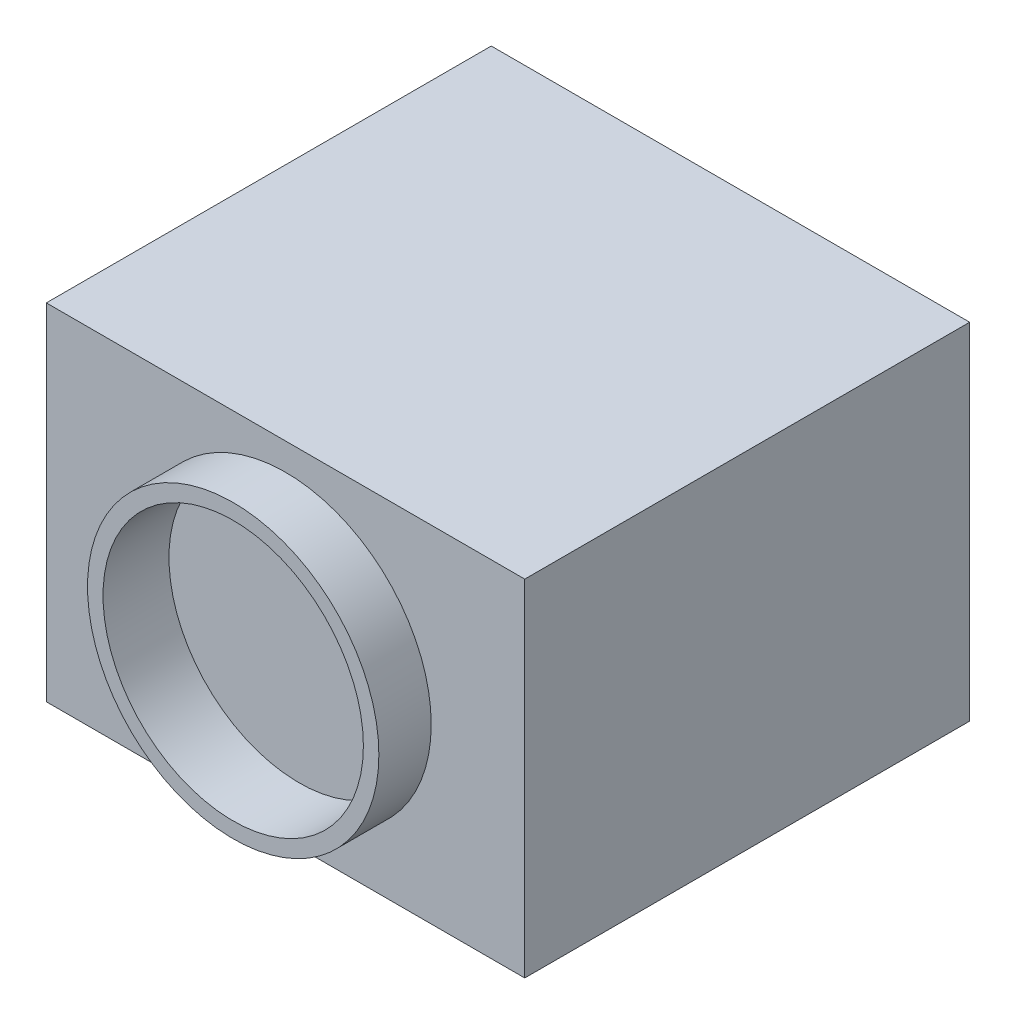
ISO-10303-21;
HEADER;
FILE_DESCRIPTION(('STEP AP214'),'2;1');
FILE_NAME('part.step','',(''),(''),'','','');
FILE_SCHEMA(('AUTOMOTIVE_DESIGN { 1 0 10303 214 1 1 1 1 }'));
ENDSEC;
DATA;
#1=APPLICATION_CONTEXT('core data for automotive mechanical design processes');
#2=APPLICATION_PROTOCOL_DEFINITION('international standard','automotive_design',2000,#1);
#3=PRODUCT_CONTEXT('',#1,'mechanical');
#4=PRODUCT('Part','Part','',(#3));
#5=PRODUCT_RELATED_PRODUCT_CATEGORY('part','',(#4));
#6=PRODUCT_DEFINITION_FORMATION('','',#4);
#7=PRODUCT_DEFINITION_CONTEXT('part definition',#1,'design');
#8=PRODUCT_DEFINITION('design','',#6,#7);
#9=PRODUCT_DEFINITION_SHAPE('','',#8);
#10=(LENGTH_UNIT() NAMED_UNIT(*) SI_UNIT(.MILLI.,.METRE.));
#11=(NAMED_UNIT(*) PLANE_ANGLE_UNIT() SI_UNIT($,.RADIAN.));
#12=(NAMED_UNIT(*) SI_UNIT($,.STERADIAN.) SOLID_ANGLE_UNIT());
#13=UNCERTAINTY_MEASURE_WITH_UNIT(LENGTH_MEASURE(1.E-05),#10,'distance_accuracy_value','');
#14=(GEOMETRIC_REPRESENTATION_CONTEXT(3) GLOBAL_UNCERTAINTY_ASSIGNED_CONTEXT((#13)) GLOBAL_UNIT_ASSIGNED_CONTEXT((#10,
#11,#12)) REPRESENTATION_CONTEXT('',''));
#15=CARTESIAN_POINT('',(0.,0.,0.));
#16=DIRECTION('',(0.,0.,1.));
#17=DIRECTION('',(1.,0.,0.));
#18=AXIS2_PLACEMENT_3D('',#15,#16,#17);
#19=CARTESIAN_POINT('',(-22.85,-16.5,0.));
#20=DIRECTION('',(0.,0.,1.));
#21=DIRECTION('',(1.,0.,0.));
#22=AXIS2_PLACEMENT_3D('',#19,#20,#21);
#23=PLANE('',#22);
#24=DIRECTION('',(0.,-1.,0.));
#25=VECTOR('',#24,1.);
#26=CARTESIAN_POINT('',(-22.85,16.5,0.));
#27=LINE('',#26,#25);
#28=CARTESIAN_POINT('',(-22.85,16.5,0.));
#29=VERTEX_POINT('',#28);
#30=CARTESIAN_POINT('',(-22.85,-16.5,0.));
#31=VERTEX_POINT('',#30);
#32=EDGE_CURVE('E195',#29,#31,#27,.T.);
#33=ORIENTED_EDGE('',*,*,#32,.F.);
#34=DIRECTION('',(-1.,0.,0.));
#35=VECTOR('',#34,1.);
#36=CARTESIAN_POINT('',(-22.85,16.5,0.));
#37=LINE('',#36,#35);
#38=CARTESIAN_POINT('',(22.85,16.5,0.));
#39=VERTEX_POINT('',#38);
#40=EDGE_CURVE('E202',#39,#29,#37,.T.);
#41=ORIENTED_EDGE('',*,*,#40,.F.);
#42=DIRECTION('',(0.,1.,0.));
#43=VECTOR('',#42,1.);
#44=CARTESIAN_POINT('',(22.85,16.5,0.));
#45=LINE('',#44,#43);
#46=CARTESIAN_POINT('',(22.85,-16.5,0.));
#47=VERTEX_POINT('',#46);
#48=EDGE_CURVE('E213',#47,#39,#45,.T.);
#49=ORIENTED_EDGE('',*,*,#48,.F.);
#50=DIRECTION('',(1.,0.,0.));
#51=VECTOR('',#50,1.);
#52=CARTESIAN_POINT('',(-22.85,-16.5,0.));
#53=LINE('',#52,#51);
#54=EDGE_CURVE('E211',#31,#47,#53,.T.);
#55=ORIENTED_EDGE('',*,*,#54,.F.);
#56=EDGE_LOOP('',(#33,#41,#49,#55));
#57=FACE_BOUND('',#56,.T.);
#58=DIRECTION('',(0.,-1.,0.));
#59=VECTOR('',#58,1.);
#60=CARTESIAN_POINT('',(7.66299935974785,-5.44476270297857,0.));
#61=LINE('',#60,#59);
#62=CARTESIAN_POINT('',(7.66299935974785,-5.44476270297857,0.));
#63=VERTEX_POINT('',#62);
#64=CARTESIAN_POINT('',(7.66299935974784,-15.6620951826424,0.));
#65=VERTEX_POINT('',#64);
#66=EDGE_CURVE('E138',#63,#65,#61,.T.);
#67=ORIENTED_EDGE('',*,*,#66,.F.);
#68=DIRECTION('',(1.,0.,0.));
#69=VECTOR('',#68,1.);
#70=CARTESIAN_POINT('',(7.66299935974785,-5.44476270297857,0.));
#71=LINE('',#70,#69);
#72=CARTESIAN_POINT('',(-5.57920128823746,-5.44476270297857,0.));
#73=VERTEX_POINT('',#72);
#74=EDGE_CURVE('E168',#73,#63,#71,.T.);
#75=ORIENTED_EDGE('',*,*,#74,.F.);
#76=DIRECTION('',(0.,1.,0.));
#77=VECTOR('',#76,1.);
#78=CARTESIAN_POINT('',(-5.57920128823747,-5.44476270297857,0.));
#79=LINE('',#78,#77);
#80=CARTESIAN_POINT('',(-5.57920128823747,-15.6620951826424,0.));
#81=VERTEX_POINT('',#80);
#82=EDGE_CURVE('E52',#81,#73,#79,.T.);
#83=ORIENTED_EDGE('',*,*,#82,.F.);
#84=DIRECTION('',(-1.,0.,0.));
#85=VECTOR('',#84,1.);
#86=CARTESIAN_POINT('',(7.66299935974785,-15.6620951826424,0.));
#87=LINE('',#86,#85);
#88=EDGE_CURVE('E47',#65,#81,#87,.T.);
#89=ORIENTED_EDGE('',*,*,#88,.F.);
#90=EDGE_LOOP('',(#67,#75,#83,#89));
#91=FACE_BOUND('',#90,.T.);
#92=CARTESIAN_POINT('',(-13.5110778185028,0.,0.));
#93=DIRECTION('',(0.,0.,1.));
#94=DIRECTION('',(1.,0.,0.));
#95=AXIS2_PLACEMENT_3D('',#92,#93,#94);
#96=CIRCLE('',#95,5.78007749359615);
#97=CARTESIAN_POINT('',(-7.73100032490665,0.,0.));
#98=VERTEX_POINT('',#97);
#99=EDGE_CURVE('E11',#98,#98,#96,.F.);
#100=ORIENTED_EDGE('',*,*,#99,.F.);
#101=EDGE_LOOP('',(#100));
#102=FACE_BOUND('',#101,.T.);
#103=ADVANCED_FACE('F32',(#57,#91,#102),#23,.F.);
#104=CARTESIAN_POINT('',(-22.85,-16.5,42.5));
#105=DIRECTION('',(0.,0.,1.));
#106=DIRECTION('',(1.,0.,0.));
#107=AXIS2_PLACEMENT_3D('',#104,#105,#106);
#108=PLANE('',#107);
#109=DIRECTION('',(0.,-1.,0.));
#110=VECTOR('',#109,1.);
#111=CARTESIAN_POINT('',(-22.85,16.5,42.5));
#112=LINE('',#111,#110);
#113=CARTESIAN_POINT('',(-22.85,16.5,42.5));
#114=VERTEX_POINT('',#113);
#115=CARTESIAN_POINT('',(-22.85,-16.5,42.5));
#116=VERTEX_POINT('',#115);
#117=EDGE_CURVE('E198',#114,#116,#112,.T.);
#118=ORIENTED_EDGE('',*,*,#117,.T.);
#119=DIRECTION('',(1.,0.,0.));
#120=VECTOR('',#119,1.);
#121=CARTESIAN_POINT('',(-22.85,-16.5,42.5));
#122=LINE('',#121,#120);
#123=CARTESIAN_POINT('',(22.85,-16.5,42.5));
#124=VERTEX_POINT('',#123);
#125=EDGE_CURVE('E201',#116,#124,#122,.T.);
#126=ORIENTED_EDGE('',*,*,#125,.T.);
#127=DIRECTION('',(0.,1.,0.));
#128=VECTOR('',#127,1.);
#129=CARTESIAN_POINT('',(22.85,16.5,42.5));
#130=LINE('',#129,#128);
#131=CARTESIAN_POINT('',(22.85,16.5,42.5));
#132=VERTEX_POINT('',#131);
#133=EDGE_CURVE('E204',#124,#132,#130,.T.);
#134=ORIENTED_EDGE('',*,*,#133,.T.);
#135=DIRECTION('',(-1.,0.,0.));
#136=VECTOR('',#135,1.);
#137=CARTESIAN_POINT('',(-22.85,16.5,42.5));
#138=LINE('',#137,#136);
#139=EDGE_CURVE('E206',#132,#114,#138,.T.);
#140=ORIENTED_EDGE('',*,*,#139,.T.);
#141=EDGE_LOOP('',(#118,#126,#134,#140));
#142=FACE_BOUND('',#141,.T.);
#143=CARTESIAN_POINT('',(0.,0.,42.5));
#144=DIRECTION('',(0.,0.,1.));
#145=DIRECTION('',(1.,0.,0.));
#146=AXIS2_PLACEMENT_3D('',#143,#144,#145);
#147=CIRCLE('',#146,13.9150736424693);
#148=CARTESIAN_POINT('',(13.9150736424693,0.,42.5));
#149=VERTEX_POINT('',#148);
#150=EDGE_CURVE('E191',#149,#149,#147,.T.);
#151=ORIENTED_EDGE('',*,*,#150,.F.);
#152=EDGE_LOOP('',(#151));
#153=FACE_BOUND('',#152,.T.);
#154=ADVANCED_FACE('F243',(#142,#153),#108,.T.);
#155=CARTESIAN_POINT('',(-22.85,16.5,42.5));
#156=DIRECTION('',(1.,0.,0.));
#157=DIRECTION('',(0.,1.,0.));
#158=AXIS2_PLACEMENT_3D('',#155,#156,#157);
#159=PLANE('',#158);
#160=ORIENTED_EDGE('',*,*,#32,.T.);
#161=DIRECTION('',(0.,0.,-1.));
#162=VECTOR('',#161,1.);
#163=CARTESIAN_POINT('',(-22.85,-16.5,42.5));
#164=LINE('',#163,#162);
#165=EDGE_CURVE('E40',#116,#31,#164,.T.);
#166=ORIENTED_EDGE('',*,*,#165,.F.);
#167=ORIENTED_EDGE('',*,*,#117,.F.);
#168=DIRECTION('',(0.,0.,-1.));
#169=VECTOR('',#168,1.);
#170=CARTESIAN_POINT('',(-22.85,16.5,42.5));
#171=LINE('',#170,#169);
#172=EDGE_CURVE('E208',#114,#29,#171,.T.);
#173=ORIENTED_EDGE('',*,*,#172,.T.);
#174=EDGE_LOOP('',(#160,#166,#167,#173));
#175=FACE_BOUND('',#174,.T.);
#176=ADVANCED_FACE('F34',(#175),#159,.F.);
#177=CARTESIAN_POINT('',(-22.85,-16.5,42.5));
#178=DIRECTION('',(0.,1.,0.));
#179=DIRECTION('',(0.,0.,1.));
#180=AXIS2_PLACEMENT_3D('',#177,#178,#179);
#181=PLANE('',#180);
#182=ORIENTED_EDGE('',*,*,#54,.T.);
#183=DIRECTION('',(0.,0.,-1.));
#184=VECTOR('',#183,1.);
#185=CARTESIAN_POINT('',(22.85,-16.5,42.5));
#186=LINE('',#185,#184);
#187=EDGE_CURVE('E221',#124,#47,#186,.T.);
#188=ORIENTED_EDGE('',*,*,#187,.F.);
#189=ORIENTED_EDGE('',*,*,#125,.F.);
#190=ORIENTED_EDGE('',*,*,#165,.T.);
#191=EDGE_LOOP('',(#182,#188,#189,#190));
#192=FACE_BOUND('',#191,.T.);
#193=ADVANCED_FACE('F226',(#192),#181,.F.);
#194=CARTESIAN_POINT('',(22.85,16.5,42.5));
#195=DIRECTION('',(-1.,0.,0.));
#196=DIRECTION('',(0.,-1.,0.));
#197=AXIS2_PLACEMENT_3D('',#194,#195,#196);
#198=PLANE('',#197);
#199=ORIENTED_EDGE('',*,*,#48,.T.);
#200=DIRECTION('',(0.,0.,-1.));
#201=VECTOR('',#200,1.);
#202=CARTESIAN_POINT('',(22.85,16.5,42.5));
#203=LINE('',#202,#201);
#204=EDGE_CURVE('E218',#132,#39,#203,.T.);
#205=ORIENTED_EDGE('',*,*,#204,.F.);
#206=ORIENTED_EDGE('',*,*,#133,.F.);
#207=ORIENTED_EDGE('',*,*,#187,.T.);
#208=EDGE_LOOP('',(#199,#205,#206,#207));
#209=FACE_BOUND('',#208,.T.);
#210=ADVANCED_FACE('F237',(#209),#198,.F.);
#211=CARTESIAN_POINT('',(-22.85,16.5,42.5));
#212=DIRECTION('',(0.,-1.,0.));
#213=DIRECTION('',(0.,0.,-1.));
#214=AXIS2_PLACEMENT_3D('',#211,#212,#213);
#215=PLANE('',#214);
#216=ORIENTED_EDGE('',*,*,#40,.T.);
#217=ORIENTED_EDGE('',*,*,#172,.F.);
#218=ORIENTED_EDGE('',*,*,#139,.F.);
#219=ORIENTED_EDGE('',*,*,#204,.T.);
#220=EDGE_LOOP('',(#216,#217,#218,#219));
#221=FACE_BOUND('',#220,.T.);
#222=ADVANCED_FACE('F241',(#221),#215,.F.);
#223=CARTESIAN_POINT('',(0.,0.,47.5));
#224=DIRECTION('',(0.,0.,-1.));
#225=DIRECTION('',(-1.,0.,0.));
#226=AXIS2_PLACEMENT_3D('',#223,#224,#225);
#227=CYLINDRICAL_SURFACE('',#226,13.9150736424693);
#228=CARTESIAN_POINT('',(0.,0.,47.5));
#229=DIRECTION('',(0.,0.,1.));
#230=DIRECTION('',(1.,0.,0.));
#231=AXIS2_PLACEMENT_3D('',#228,#229,#230);
#232=CIRCLE('',#231,13.9150736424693);
#233=CARTESIAN_POINT('',(13.9150736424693,0.,47.5));
#234=VERTEX_POINT('',#233);
#235=EDGE_CURVE('E192',#234,#234,#232,.T.);
#236=ORIENTED_EDGE('',*,*,#235,.F.);
#237=EDGE_LOOP('',(#236));
#238=FACE_BOUND('',#237,.T.);
#239=ORIENTED_EDGE('',*,*,#150,.T.);
#240=EDGE_LOOP('',(#239));
#241=FACE_BOUND('',#240,.T.);
#242=ADVANCED_FACE('F249',(#238,#241),#227,.T.);
#243=CARTESIAN_POINT('',(0.,0.,47.5));
#244=DIRECTION('',(0.,0.,1.));
#245=DIRECTION('',(1.,0.,0.));
#246=AXIS2_PLACEMENT_3D('',#243,#244,#245);
#247=PLANE('',#246);
#248=CARTESIAN_POINT('',(0.,0.,47.5));
#249=DIRECTION('',(0.,0.,1.));
#250=DIRECTION('',(1.,0.,0.));
#251=AXIS2_PLACEMENT_3D('',#248,#249,#250);
#252=CIRCLE('',#251,12.4355691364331);
#253=CARTESIAN_POINT('',(12.4355691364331,0.,47.5));
#254=VERTEX_POINT('',#253);
#255=EDGE_CURVE('E350',#254,#254,#252,.T.);
#256=ORIENTED_EDGE('',*,*,#255,.F.);
#257=EDGE_LOOP('',(#256));
#258=FACE_BOUND('',#257,.T.);
#259=ORIENTED_EDGE('',*,*,#235,.T.);
#260=EDGE_LOOP('',(#259));
#261=FACE_BOUND('',#260,.T.);
#262=ADVANCED_FACE('F251',(#258,#261),#247,.T.);
#263=CARTESIAN_POINT('',(7.66299935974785,-15.6620951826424,-6.3));
#264=DIRECTION('',(0.,0.,-1.));
#265=DIRECTION('',(-1.,0.,0.));
#266=AXIS2_PLACEMENT_3D('',#263,#264,#265);
#267=PLANE('',#266);
#268=DIRECTION('',(0.,-1.,0.));
#269=VECTOR('',#268,1.);
#270=CARTESIAN_POINT('',(7.66299935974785,-5.44476270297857,-6.3));
#271=LINE('',#270,#269);
#272=CARTESIAN_POINT('',(7.66299935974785,-5.44476270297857,-6.3));
#273=VERTEX_POINT('',#272);
#274=CARTESIAN_POINT('',(7.66299935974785,-15.6620951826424,-6.3));
#275=VERTEX_POINT('',#274);
#276=EDGE_CURVE('E164',#273,#275,#271,.T.);
#277=ORIENTED_EDGE('',*,*,#276,.T.);
#278=DIRECTION('',(-1.,0.,0.));
#279=VECTOR('',#278,1.);
#280=CARTESIAN_POINT('',(7.66299935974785,-15.6620951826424,-6.3));
#281=LINE('',#280,#279);
#282=CARTESIAN_POINT('',(-5.57920128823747,-15.6620951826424,-6.3));
#283=VERTEX_POINT('',#282);
#284=EDGE_CURVE('E167',#275,#283,#281,.T.);
#285=ORIENTED_EDGE('',*,*,#284,.T.);
#286=DIRECTION('',(0.,1.,0.));
#287=VECTOR('',#286,1.);
#288=CARTESIAN_POINT('',(-5.57920128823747,-5.44476270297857,-6.3));
#289=LINE('',#288,#287);
#290=CARTESIAN_POINT('',(-5.57920128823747,-5.44476270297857,-6.3));
#291=VERTEX_POINT('',#290);
#292=EDGE_CURVE('E170',#283,#291,#289,.T.);
#293=ORIENTED_EDGE('',*,*,#292,.T.);
#294=DIRECTION('',(1.,0.,0.));
#295=VECTOR('',#294,1.);
#296=CARTESIAN_POINT('',(7.66299935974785,-5.44476270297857,-6.3));
#297=LINE('',#296,#295);
#298=EDGE_CURVE('E172',#291,#273,#297,.T.);
#299=ORIENTED_EDGE('',*,*,#298,.T.);
#300=EDGE_LOOP('',(#277,#285,#293,#299));
#301=FACE_BOUND('',#300,.T.);
#302=DIRECTION('',(-1.,0.,0.));
#303=VECTOR('',#302,1.);
#304=CARTESIAN_POINT('',(6.5202713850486,-14.5865865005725,-6.3));
#305=LINE('',#304,#303);
#306=CARTESIAN_POINT('',(6.5202713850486,-14.5865865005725,-6.3));
#307=VERTEX_POINT('',#306);
#308=CARTESIAN_POINT('',(-4.43647331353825,-14.5865865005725,-6.3));
#309=VERTEX_POINT('',#308);
#310=EDGE_CURVE('E130',#307,#309,#305,.T.);
#311=ORIENTED_EDGE('',*,*,#310,.F.);
#312=DIRECTION('',(0.,-1.,0.));
#313=VECTOR('',#312,1.);
#314=CARTESIAN_POINT('',(6.5202713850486,-6.52027138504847,-6.3));
#315=LINE('',#314,#313);
#316=CARTESIAN_POINT('',(6.5202713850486,-6.52027138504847,-6.3));
#317=VERTEX_POINT('',#316);
#318=EDGE_CURVE('E120',#317,#307,#315,.T.);
#319=ORIENTED_EDGE('',*,*,#318,.F.);
#320=DIRECTION('',(1.,0.,0.));
#321=VECTOR('',#320,1.);
#322=CARTESIAN_POINT('',(6.5202713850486,-6.52027138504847,-6.3));
#323=LINE('',#322,#321);
#324=CARTESIAN_POINT('',(-4.43647331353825,-6.52027138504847,-6.3));
#325=VERTEX_POINT('',#324);
#326=EDGE_CURVE('E146',#325,#317,#323,.T.);
#327=ORIENTED_EDGE('',*,*,#326,.F.);
#328=DIRECTION('',(0.,1.,0.));
#329=VECTOR('',#328,1.);
#330=CARTESIAN_POINT('',(-4.43647331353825,-6.52027138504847,-6.3));
#331=LINE('',#330,#329);
#332=EDGE_CURVE('E144',#309,#325,#331,.T.);
#333=ORIENTED_EDGE('',*,*,#332,.F.);
#334=EDGE_LOOP('',(#311,#319,#327,#333));
#335=FACE_BOUND('',#334,.T.);
#336=ADVANCED_FACE('F142',(#301,#335),#267,.T.);
#337=CARTESIAN_POINT('',(7.66299935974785,-5.44476270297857,-6.3));
#338=DIRECTION('',(-1.,0.,0.));
#339=DIRECTION('',(0.,0.,1.));
#340=AXIS2_PLACEMENT_3D('',#337,#338,#339);
#341=PLANE('',#340);
#342=ORIENTED_EDGE('',*,*,#66,.T.);
#343=DIRECTION('',(0.,0.,1.));
#344=VECTOR('',#343,1.);
#345=CARTESIAN_POINT('',(7.66299935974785,-15.6620951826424,-6.3));
#346=LINE('',#345,#344);
#347=EDGE_CURVE('E189',#275,#65,#346,.T.);
#348=ORIENTED_EDGE('',*,*,#347,.F.);
#349=ORIENTED_EDGE('',*,*,#276,.F.);
#350=DIRECTION('',(0.,0.,1.));
#351=VECTOR('',#350,1.);
#352=CARTESIAN_POINT('',(7.66299935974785,-5.44476270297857,-6.3));
#353=LINE('',#352,#351);
#354=EDGE_CURVE('E174',#273,#63,#353,.T.);
#355=ORIENTED_EDGE('',*,*,#354,.T.);
#356=EDGE_LOOP('',(#342,#348,#349,#355));
#357=FACE_BOUND('',#356,.T.);
#358=ADVANCED_FACE('F302',(#357),#341,.F.);
#359=CARTESIAN_POINT('',(7.66299935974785,-15.6620951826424,-6.3));
#360=DIRECTION('',(0.,1.,0.));
#361=DIRECTION('',(0.,0.,1.));
#362=AXIS2_PLACEMENT_3D('',#359,#360,#361);
#363=PLANE('',#362);
#364=ORIENTED_EDGE('',*,*,#88,.T.);
#365=DIRECTION('',(0.,0.,1.));
#366=VECTOR('',#365,1.);
#367=CARTESIAN_POINT('',(-5.57920128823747,-15.6620951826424,-6.3));
#368=LINE('',#367,#366);
#369=EDGE_CURVE('E186',#283,#81,#368,.T.);
#370=ORIENTED_EDGE('',*,*,#369,.F.);
#371=ORIENTED_EDGE('',*,*,#284,.F.);
#372=ORIENTED_EDGE('',*,*,#347,.T.);
#373=EDGE_LOOP('',(#364,#370,#371,#372));
#374=FACE_BOUND('',#373,.T.);
#375=ADVANCED_FACE('F310',(#374),#363,.F.);
#376=CARTESIAN_POINT('',(-5.57920128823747,-5.44476270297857,-6.3));
#377=DIRECTION('',(1.,0.,0.));
#378=DIRECTION('',(0.,0.,-1.));
#379=AXIS2_PLACEMENT_3D('',#376,#377,#378);
#380=PLANE('',#379);
#381=ORIENTED_EDGE('',*,*,#82,.T.);
#382=DIRECTION('',(0.,0.,1.));
#383=VECTOR('',#382,1.);
#384=CARTESIAN_POINT('',(-5.57920128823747,-5.44476270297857,-6.3));
#385=LINE('',#384,#383);
#386=EDGE_CURVE('E183',#291,#73,#385,.T.);
#387=ORIENTED_EDGE('',*,*,#386,.F.);
#388=ORIENTED_EDGE('',*,*,#292,.F.);
#389=ORIENTED_EDGE('',*,*,#369,.T.);
#390=EDGE_LOOP('',(#381,#387,#388,#389));
#391=FACE_BOUND('',#390,.T.);
#392=ADVANCED_FACE('F306',(#391),#380,.F.);
#393=CARTESIAN_POINT('',(7.66299935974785,-5.44476270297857,-6.3));
#394=DIRECTION('',(0.,-1.,0.));
#395=DIRECTION('',(0.,0.,-1.));
#396=AXIS2_PLACEMENT_3D('',#393,#394,#395);
#397=PLANE('',#396);
#398=ORIENTED_EDGE('',*,*,#74,.T.);
#399=ORIENTED_EDGE('',*,*,#354,.F.);
#400=ORIENTED_EDGE('',*,*,#298,.F.);
#401=ORIENTED_EDGE('',*,*,#386,.T.);
#402=EDGE_LOOP('',(#398,#399,#400,#401));
#403=FACE_BOUND('',#402,.T.);
#404=ADVANCED_FACE('F299',(#403),#397,.F.);
#405=CARTESIAN_POINT('',(6.5202713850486,-6.52027138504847,-6.3));
#406=DIRECTION('',(-1.,0.,0.));
#407=DIRECTION('',(0.,0.,1.));
#408=AXIS2_PLACEMENT_3D('',#405,#406,#407);
#409=PLANE('',#408);
#410=DIRECTION('',(0.,-1.,0.));
#411=VECTOR('',#410,1.);
#412=CARTESIAN_POINT('',(6.5202713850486,-6.52027138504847,0.));
#413=LINE('',#412,#411);
#414=CARTESIAN_POINT('',(6.52027138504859,-6.52027138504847,0.));
#415=VERTEX_POINT('',#414);
#416=CARTESIAN_POINT('',(6.5202713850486,-14.5865865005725,0.));
#417=VERTEX_POINT('',#416);
#418=EDGE_CURVE('E151',#415,#417,#413,.T.);
#419=ORIENTED_EDGE('',*,*,#418,.F.);
#420=DIRECTION('',(0.,0.,1.));
#421=VECTOR('',#420,1.);
#422=CARTESIAN_POINT('',(6.5202713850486,-6.52027138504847,-6.3));
#423=LINE('',#422,#421);
#424=EDGE_CURVE('E126',#317,#415,#423,.T.);
#425=ORIENTED_EDGE('',*,*,#424,.F.);
#426=ORIENTED_EDGE('',*,*,#318,.T.);
#427=DIRECTION('',(0.,0.,1.));
#428=VECTOR('',#427,1.);
#429=CARTESIAN_POINT('',(6.5202713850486,-14.5865865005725,-6.3));
#430=LINE('',#429,#428);
#431=EDGE_CURVE('E124',#307,#417,#430,.T.);
#432=ORIENTED_EDGE('',*,*,#431,.T.);
#433=EDGE_LOOP('',(#419,#425,#426,#432));
#434=FACE_BOUND('',#433,.T.);
#435=ADVANCED_FACE('F123',(#434),#409,.T.);
#436=CARTESIAN_POINT('',(6.5202713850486,-14.5865865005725,-6.3));
#437=DIRECTION('',(0.,1.,0.));
#438=DIRECTION('',(0.,0.,1.));
#439=AXIS2_PLACEMENT_3D('',#436,#437,#438);
#440=PLANE('',#439);
#441=DIRECTION('',(-1.,0.,0.));
#442=VECTOR('',#441,1.);
#443=CARTESIAN_POINT('',(6.5202713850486,-14.5865865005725,0.));
#444=LINE('',#443,#442);
#445=CARTESIAN_POINT('',(-4.43647331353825,-14.5865865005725,0.));
#446=VERTEX_POINT('',#445);
#447=EDGE_CURVE('E137',#417,#446,#444,.T.);
#448=ORIENTED_EDGE('',*,*,#447,.F.);
#449=ORIENTED_EDGE('',*,*,#431,.F.);
#450=ORIENTED_EDGE('',*,*,#310,.T.);
#451=DIRECTION('',(0.,0.,1.));
#452=VECTOR('',#451,1.);
#453=CARTESIAN_POINT('',(-4.43647331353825,-14.5865865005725,-6.3));
#454=LINE('',#453,#452);
#455=EDGE_CURVE('E139',#309,#446,#454,.T.);
#456=ORIENTED_EDGE('',*,*,#455,.T.);
#457=EDGE_LOOP('',(#448,#449,#450,#456));
#458=FACE_BOUND('',#457,.T.);
#459=ADVANCED_FACE('F134',(#458),#440,.T.);
#460=CARTESIAN_POINT('',(-4.43647331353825,-6.52027138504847,-6.3));
#461=DIRECTION('',(1.,0.,0.));
#462=DIRECTION('',(0.,0.,-1.));
#463=AXIS2_PLACEMENT_3D('',#460,#461,#462);
#464=PLANE('',#463);
#465=DIRECTION('',(0.,1.,0.));
#466=VECTOR('',#465,1.);
#467=CARTESIAN_POINT('',(-4.43647331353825,-6.52027138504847,0.));
#468=LINE('',#467,#466);
#469=CARTESIAN_POINT('',(-4.43647331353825,-6.52027138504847,0.));
#470=VERTEX_POINT('',#469);
#471=EDGE_CURVE('E155',#446,#470,#468,.T.);
#472=ORIENTED_EDGE('',*,*,#471,.F.);
#473=ORIENTED_EDGE('',*,*,#455,.F.);
#474=ORIENTED_EDGE('',*,*,#332,.T.);
#475=DIRECTION('',(0.,0.,1.));
#476=VECTOR('',#475,1.);
#477=CARTESIAN_POINT('',(-4.43647331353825,-6.52027138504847,-6.3));
#478=LINE('',#477,#476);
#479=EDGE_CURVE('E161',#325,#470,#478,.T.);
#480=ORIENTED_EDGE('',*,*,#479,.T.);
#481=EDGE_LOOP('',(#472,#473,#474,#480));
#482=FACE_BOUND('',#481,.T.);
#483=ADVANCED_FACE('F283',(#482),#464,.T.);
#484=CARTESIAN_POINT('',(6.5202713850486,-6.52027138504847,-6.3));
#485=DIRECTION('',(0.,-1.,0.));
#486=DIRECTION('',(0.,0.,-1.));
#487=AXIS2_PLACEMENT_3D('',#484,#485,#486);
#488=PLANE('',#487);
#489=DIRECTION('',(1.,0.,0.));
#490=VECTOR('',#489,1.);
#491=CARTESIAN_POINT('',(6.5202713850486,-6.52027138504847,0.));
#492=LINE('',#491,#490);
#493=EDGE_CURVE('E131',#470,#415,#492,.T.);
#494=ORIENTED_EDGE('',*,*,#493,.F.);
#495=ORIENTED_EDGE('',*,*,#479,.F.);
#496=ORIENTED_EDGE('',*,*,#326,.T.);
#497=ORIENTED_EDGE('',*,*,#424,.T.);
#498=EDGE_LOOP('',(#494,#495,#496,#497));
#499=FACE_BOUND('',#498,.T.);
#500=ADVANCED_FACE('F274',(#499),#488,.T.);
#501=ORIENTED_EDGE('',*,*,#493,.T.);
#502=ORIENTED_EDGE('',*,*,#418,.T.);
#503=ORIENTED_EDGE('',*,*,#447,.T.);
#504=ORIENTED_EDGE('',*,*,#471,.T.);
#505=EDGE_LOOP('',(#501,#502,#503,#504));
#506=FACE_BOUND('',#505,.T.);
#507=ADVANCED_FACE('F265',(#506),#23,.F.);
#508=CARTESIAN_POINT('',(-13.5110778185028,0.,-6.3));
#509=DIRECTION('',(0.,0.,-1.));
#510=DIRECTION('',(-1.,0.,0.));
#511=AXIS2_PLACEMENT_3D('',#508,#509,#510);
#512=PLANE('',#511);
#513=CARTESIAN_POINT('',(-13.5110778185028,0.,-6.3));
#514=DIRECTION('',(0.,0.,-1.));
#515=DIRECTION('',(-1.,0.,0.));
#516=AXIS2_PLACEMENT_3D('',#513,#514,#515);
#517=CIRCLE('',#516,5.78007749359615);
#518=CARTESIAN_POINT('',(-19.291155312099,0.,-6.3));
#519=VERTEX_POINT('',#518);
#520=EDGE_CURVE('E153',#519,#519,#517,.T.);
#521=ORIENTED_EDGE('',*,*,#520,.T.);
#522=EDGE_LOOP('',(#521));
#523=FACE_BOUND('',#522,.T.);
#524=CARTESIAN_POINT('',(-13.5110778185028,0.,-6.3));
#525=DIRECTION('',(0.,0.,-1.));
#526=DIRECTION('',(-1.,0.,0.));
#527=AXIS2_PLACEMENT_3D('',#524,#525,#526);
#528=CIRCLE('',#527,5.04144694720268);
#529=CARTESIAN_POINT('',(-18.5525247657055,0.,-6.3));
#530=VERTEX_POINT('',#529);
#531=EDGE_CURVE('E353',#530,#530,#528,.T.);
#532=ORIENTED_EDGE('',*,*,#531,.F.);
#533=EDGE_LOOP('',(#532));
#534=FACE_BOUND('',#533,.T.);
#535=ADVANCED_FACE('F273',(#523,#534),#512,.T.);
#536=CARTESIAN_POINT('',(-13.5110778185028,0.,-6.3));
#537=DIRECTION('',(0.,0.,1.));
#538=DIRECTION('',(1.,0.,0.));
#539=AXIS2_PLACEMENT_3D('',#536,#537,#538);
#540=CYLINDRICAL_SURFACE('',#539,5.78007749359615);
#541=ORIENTED_EDGE('',*,*,#520,.F.);
#542=EDGE_LOOP('',(#541));
#543=FACE_BOUND('',#542,.T.);
#544=ORIENTED_EDGE('',*,*,#99,.T.);
#545=EDGE_LOOP('',(#544));
#546=FACE_BOUND('',#545,.T.);
#547=ADVANCED_FACE('F280',(#543,#546),#540,.T.);
#548=CARTESIAN_POINT('',(-13.5110778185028,0.,-6.3));
#549=DIRECTION('',(0.,0.,1.));
#550=DIRECTION('',(1.,0.,0.));
#551=AXIS2_PLACEMENT_3D('',#548,#549,#550);
#552=CYLINDRICAL_SURFACE('',#551,5.04144694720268);
#553=ORIENTED_EDGE('',*,*,#531,.T.);
#554=EDGE_LOOP('',(#553));
#555=FACE_BOUND('',#554,.T.);
#556=CARTESIAN_POINT('',(-13.5110778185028,0.,0.));
#557=DIRECTION('',(0.,0.,-1.));
#558=DIRECTION('',(-1.,0.,0.));
#559=AXIS2_PLACEMENT_3D('',#556,#557,#558);
#560=CIRCLE('',#559,5.04144694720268);
#561=CARTESIAN_POINT('',(-18.5525247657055,0.,0.));
#562=VERTEX_POINT('',#561);
#563=EDGE_CURVE('E349',#562,#562,#560,.T.);
#564=ORIENTED_EDGE('',*,*,#563,.F.);
#565=EDGE_LOOP('',(#564));
#566=FACE_BOUND('',#565,.T.);
#567=ADVANCED_FACE('F270',(#555,#566),#552,.F.);
#568=ORIENTED_EDGE('',*,*,#563,.T.);
#569=EDGE_LOOP('',(#568));
#570=FACE_BOUND('',#569,.T.);
#571=ADVANCED_FACE('F264',(#570),#23,.F.);
#572=CARTESIAN_POINT('',(0.,0.,41.2));
#573=DIRECTION('',(0.,0.,1.));
#574=DIRECTION('',(1.,0.,0.));
#575=AXIS2_PLACEMENT_3D('',#572,#573,#574);
#576=CYLINDRICAL_SURFACE('',#575,12.4355691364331);
#577=CARTESIAN_POINT('',(0.,0.,41.2));
#578=DIRECTION('',(0.,0.,1.));
#579=DIRECTION('',(1.,0.,0.));
#580=AXIS2_PLACEMENT_3D('',#577,#578,#579);
#581=CIRCLE('',#580,12.4355691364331);
#582=CARTESIAN_POINT('',(12.4355691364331,0.,41.2));
#583=VERTEX_POINT('',#582);
#584=EDGE_CURVE('E348',#583,#583,#581,.T.);
#585=ORIENTED_EDGE('',*,*,#584,.F.);
#586=EDGE_LOOP('',(#585));
#587=FACE_BOUND('',#586,.T.);
#588=ORIENTED_EDGE('',*,*,#255,.T.);
#589=EDGE_LOOP('',(#588));
#590=FACE_BOUND('',#589,.T.);
#591=ADVANCED_FACE('F269',(#587,#590),#576,.F.);
#592=CARTESIAN_POINT('',(0.,0.,41.2));
#593=DIRECTION('',(0.,0.,1.));
#594=DIRECTION('',(1.,0.,0.));
#595=AXIS2_PLACEMENT_3D('',#592,#593,#594);
#596=PLANE('',#595);
#597=ORIENTED_EDGE('',*,*,#584,.T.);
#598=EDGE_LOOP('',(#597));
#599=FACE_BOUND('',#598,.T.);
#600=ADVANCED_FACE('F340',(#599),#596,.T.);
#601=CLOSED_SHELL('',(#103,#154,#176,#193,#210,#222,#242,#262,#336,#358,#375,#392,#404,#435,
#459,#483,#500,#507,#535,#547,#567,#571,#591,#600));
#602=MANIFOLD_SOLID_BREP('B2',#601);
#603=ADVANCED_BREP_SHAPE_REPRESENTATION('',(#18,#602),#14);
#604=SHAPE_DEFINITION_REPRESENTATION(#9,#603);
ENDSEC;
END-ISO-10303-21;
